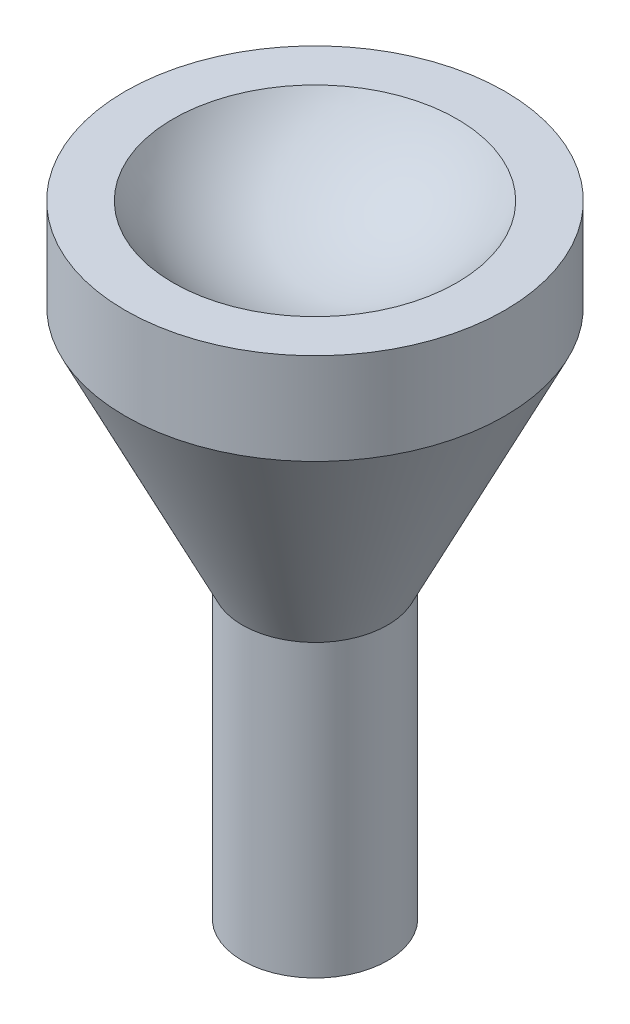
from build123d import *


with BuildPart() as part:
    # Sketch1 → Revolve1 (revolve)
    with BuildSketch(Plane.XY, mode=Mode.PRIVATE) as revolve1_sk:
        with BuildLine():
            Line((0, 0), (2.5, 0))
            Line((2.5, 0), (2.5, 10))
            Line((2.5, 10), (6.529837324, 18.243122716))
            Line((6.529837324, 18.243122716), (6.529837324, 21.394528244))
            Line((6.529837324, 21.394528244), (4.883580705, 21.394528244))
            ThreePointArc((4.883580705, 21.394528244), (2.791178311, 19.411428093), (0, 18.690208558))
            Line((0, 18.690208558), (0, 0))
        make_face()
    revolve(revolve1_sk.sketch.rotate(Axis((0, 18.690208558, 0), (0, -1, 0)), 90), axis=Axis((0, 18.690208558, 0), (0, -1, 0)))


solid = part.part
